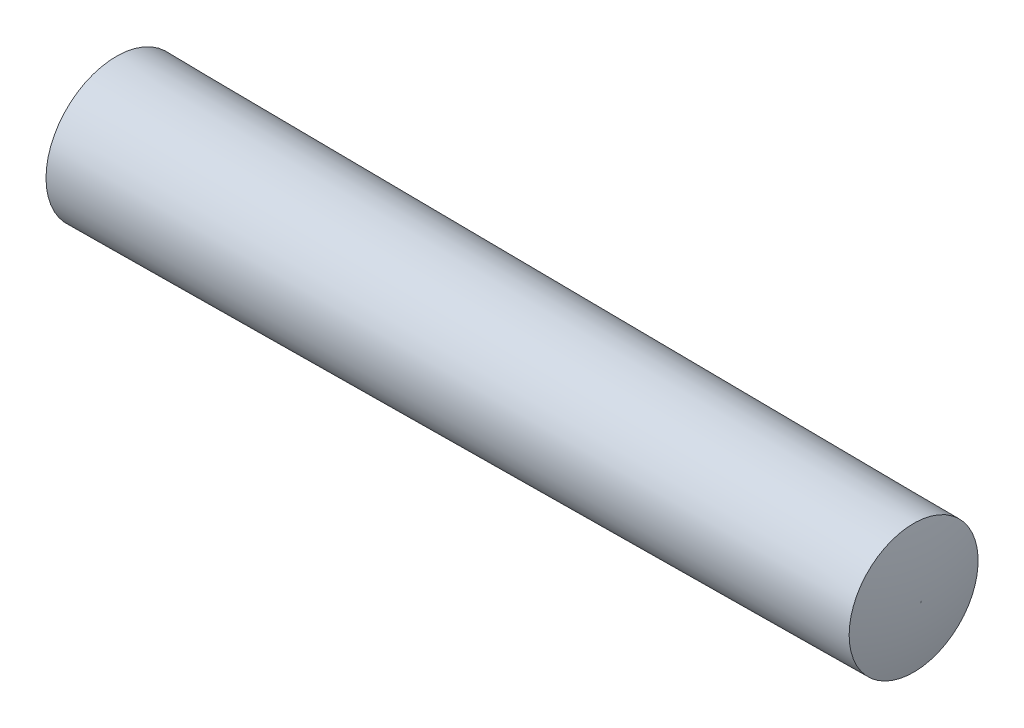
from build123d import *


with BuildPart() as part:
    # Sketch1 → Base-Revolve (revolve)
    with BuildSketch(Plane.XY, mode=Mode.PRIVATE) as base_revolve_sk:
        with BuildLine():
            Line((0, 0), (0, 0.089662))
            ThreePointArc((0, 0.089662), (0.28005076, 4.562860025), (1.11582948, 8.9662))
            Line((1.11582948, 8.9662), (102.71582948, 8.219016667))
            ThreePointArc((102.71582948, 8.219016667), (103.415171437, 4.181048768), (103.649304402, 0.089662))
            Line((103.649304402, 0.089662), (103.649304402, 0))
            Line((103.649304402, 0), (0, 0))
        make_face()
    revolve(base_revolve_sk.sketch.rotate(Axis((-5.588, 0, 0), (1, 0, 0)), 90), axis=Axis((-5.588, 0, 0), (1, 0, 0)))


solid = part.part
